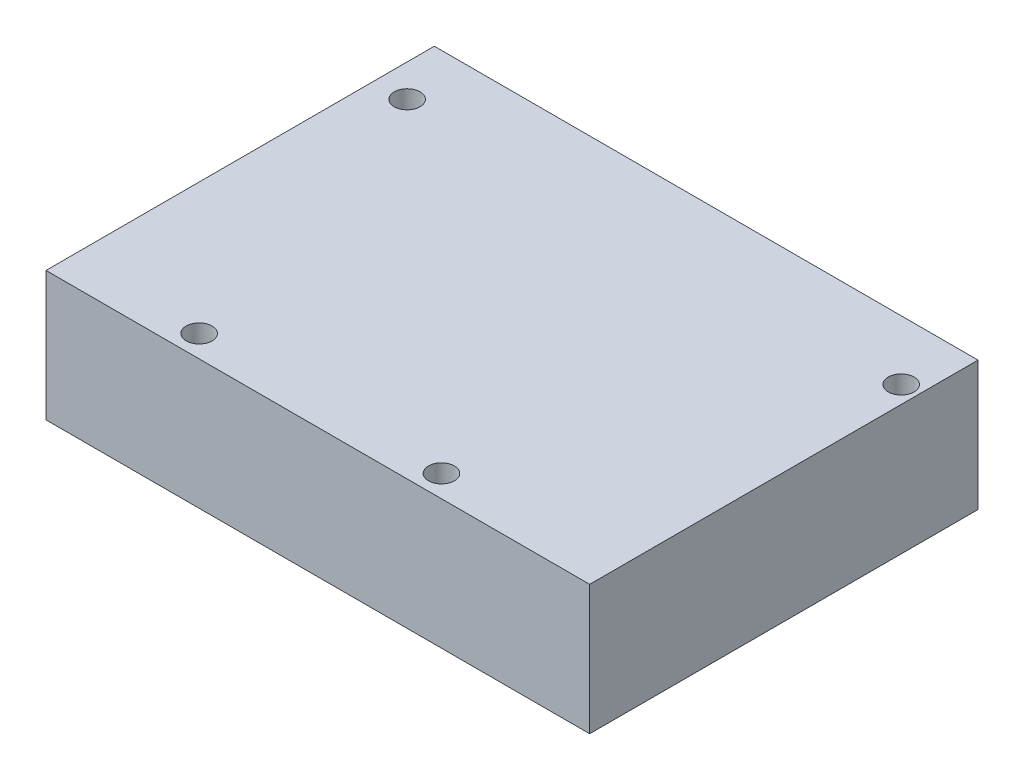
ISO-10303-21;
HEADER;
FILE_DESCRIPTION(('STEP AP214'),'2;1');
FILE_NAME('part.step','',(''),(''),'','','');
FILE_SCHEMA(('AUTOMOTIVE_DESIGN { 1 0 10303 214 1 1 1 1 }'));
ENDSEC;
DATA;
#1=APPLICATION_CONTEXT('core data for automotive mechanical design processes');
#2=APPLICATION_PROTOCOL_DEFINITION('international standard','automotive_design',2000,#1);
#3=PRODUCT_CONTEXT('',#1,'mechanical');
#4=PRODUCT('Part','Part','',(#3));
#5=PRODUCT_RELATED_PRODUCT_CATEGORY('part','',(#4));
#6=PRODUCT_DEFINITION_FORMATION('','',#4);
#7=PRODUCT_DEFINITION_CONTEXT('part definition',#1,'design');
#8=PRODUCT_DEFINITION('design','',#6,#7);
#9=PRODUCT_DEFINITION_SHAPE('','',#8);
#10=(LENGTH_UNIT() NAMED_UNIT(*) SI_UNIT(.MILLI.,.METRE.));
#11=(NAMED_UNIT(*) PLANE_ANGLE_UNIT() SI_UNIT($,.RADIAN.));
#12=(NAMED_UNIT(*) SI_UNIT($,.STERADIAN.) SOLID_ANGLE_UNIT());
#13=UNCERTAINTY_MEASURE_WITH_UNIT(LENGTH_MEASURE(1.E-05),#10,'distance_accuracy_value','');
#14=(GEOMETRIC_REPRESENTATION_CONTEXT(3) GLOBAL_UNCERTAINTY_ASSIGNED_CONTEXT((#13)) GLOBAL_UNIT_ASSIGNED_CONTEXT((#10,
#11,#12)) REPRESENTATION_CONTEXT('',''));
#15=CARTESIAN_POINT('',(0.,0.,0.));
#16=DIRECTION('',(0.,0.,1.));
#17=DIRECTION('',(1.,0.,0.));
#18=AXIS2_PLACEMENT_3D('',#15,#16,#17);
#19=CARTESIAN_POINT('',(-8.5,-5.,-7.5));
#20=DIRECTION('',(-1.,0.,0.));
#21=DIRECTION('',(0.,0.,1.));
#22=AXIS2_PLACEMENT_3D('',#19,#20,#21);
#23=PLANE('',#22);
#24=DIRECTION('',(0.,0.,1.));
#25=VECTOR('',#24,1.);
#26=CARTESIAN_POINT('',(-8.5,0.,-7.5));
#27=LINE('',#26,#25);
#28=CARTESIAN_POINT('',(-8.5,0.,-7.5));
#29=VERTEX_POINT('',#28);
#30=CARTESIAN_POINT('',(-8.5,0.,7.5));
#31=VERTEX_POINT('',#30);
#32=EDGE_CURVE('E116',#29,#31,#27,.T.);
#33=ORIENTED_EDGE('',*,*,#32,.F.);
#34=DIRECTION('',(0.,1.,0.));
#35=VECTOR('',#34,1.);
#36=CARTESIAN_POINT('',(-8.5,-5.,-7.5));
#37=LINE('',#36,#35);
#38=CARTESIAN_POINT('',(-8.5,-5.,-7.5));
#39=VERTEX_POINT('',#38);
#40=EDGE_CURVE('E11',#39,#29,#37,.T.);
#41=ORIENTED_EDGE('',*,*,#40,.F.);
#42=DIRECTION('',(0.,0.,1.));
#43=VECTOR('',#42,1.);
#44=CARTESIAN_POINT('',(-8.5,-5.,-7.5));
#45=LINE('',#44,#43);
#46=CARTESIAN_POINT('',(-8.5,-5.,7.5));
#47=VERTEX_POINT('',#46);
#48=EDGE_CURVE('E107',#39,#47,#45,.T.);
#49=ORIENTED_EDGE('',*,*,#48,.T.);
#50=DIRECTION('',(0.,1.,0.));
#51=VECTOR('',#50,1.);
#52=CARTESIAN_POINT('',(-8.5,-5.,7.5));
#53=LINE('',#52,#51);
#54=EDGE_CURVE('E48',#47,#31,#53,.T.);
#55=ORIENTED_EDGE('',*,*,#54,.T.);
#56=EDGE_LOOP('',(#33,#41,#49,#55));
#57=FACE_BOUND('',#56,.T.);
#58=ADVANCED_FACE('F45',(#57),#23,.T.);
#59=CARTESIAN_POINT('',(-8.5,-5.,-7.5));
#60=DIRECTION('',(0.,0.,-1.));
#61=DIRECTION('',(-1.,0.,0.));
#62=AXIS2_PLACEMENT_3D('',#59,#60,#61);
#63=PLANE('',#62);
#64=DIRECTION('',(-1.,0.,0.));
#65=VECTOR('',#64,1.);
#66=CARTESIAN_POINT('',(-8.5,0.,-7.5));
#67=LINE('',#66,#65);
#68=CARTESIAN_POINT('',(12.5,0.,-7.5));
#69=VERTEX_POINT('',#68);
#70=EDGE_CURVE('E110',#69,#29,#67,.T.);
#71=ORIENTED_EDGE('',*,*,#70,.F.);
#72=DIRECTION('',(0.,1.,0.));
#73=VECTOR('',#72,1.);
#74=CARTESIAN_POINT('',(12.5,-5.,-7.5));
#75=LINE('',#74,#73);
#76=CARTESIAN_POINT('',(12.5,-5.,-7.5));
#77=VERTEX_POINT('',#76);
#78=EDGE_CURVE('E55',#77,#69,#75,.T.);
#79=ORIENTED_EDGE('',*,*,#78,.F.);
#80=DIRECTION('',(-1.,0.,0.));
#81=VECTOR('',#80,1.);
#82=CARTESIAN_POINT('',(-8.5,-5.,-7.5));
#83=LINE('',#82,#81);
#84=EDGE_CURVE('E102',#77,#39,#83,.T.);
#85=ORIENTED_EDGE('',*,*,#84,.T.);
#86=ORIENTED_EDGE('',*,*,#40,.T.);
#87=EDGE_LOOP('',(#71,#79,#85,#86));
#88=FACE_BOUND('',#87,.T.);
#89=ADVANCED_FACE('F133',(#88),#63,.T.);
#90=CARTESIAN_POINT('',(12.5,-5.,-7.5));
#91=DIRECTION('',(1.,0.,0.));
#92=DIRECTION('',(0.,0.,-1.));
#93=AXIS2_PLACEMENT_3D('',#90,#91,#92);
#94=PLANE('',#93);
#95=DIRECTION('',(0.,0.,-1.));
#96=VECTOR('',#95,1.);
#97=CARTESIAN_POINT('',(12.5,0.,-7.5));
#98=LINE('',#97,#96);
#99=CARTESIAN_POINT('',(12.5,0.,7.5));
#100=VERTEX_POINT('',#99);
#101=EDGE_CURVE('E96',#100,#69,#98,.T.);
#102=ORIENTED_EDGE('',*,*,#101,.F.);
#103=DIRECTION('',(0.,1.,0.));
#104=VECTOR('',#103,1.);
#105=CARTESIAN_POINT('',(12.5,-5.,7.5));
#106=LINE('',#105,#104);
#107=CARTESIAN_POINT('',(12.5,-5.,7.5));
#108=VERTEX_POINT('',#107);
#109=EDGE_CURVE('E91',#108,#100,#106,.T.);
#110=ORIENTED_EDGE('',*,*,#109,.F.);
#111=DIRECTION('',(0.,0.,-1.));
#112=VECTOR('',#111,1.);
#113=CARTESIAN_POINT('',(12.5,-5.,-7.5));
#114=LINE('',#113,#112);
#115=EDGE_CURVE('E94',#108,#77,#114,.T.);
#116=ORIENTED_EDGE('',*,*,#115,.T.);
#117=ORIENTED_EDGE('',*,*,#78,.T.);
#118=EDGE_LOOP('',(#102,#110,#116,#117));
#119=FACE_BOUND('',#118,.T.);
#120=ADVANCED_FACE('F93',(#119),#94,.T.);
#121=CARTESIAN_POINT('',(-8.5,-5.,7.5));
#122=DIRECTION('',(0.,0.,1.));
#123=DIRECTION('',(1.,0.,0.));
#124=AXIS2_PLACEMENT_3D('',#121,#122,#123);
#125=PLANE('',#124);
#126=DIRECTION('',(1.,0.,0.));
#127=VECTOR('',#126,1.);
#128=CARTESIAN_POINT('',(-8.5,0.,7.5));
#129=LINE('',#128,#127);
#130=EDGE_CURVE('E120',#31,#100,#129,.T.);
#131=ORIENTED_EDGE('',*,*,#130,.F.);
#132=ORIENTED_EDGE('',*,*,#54,.F.);
#133=DIRECTION('',(1.,0.,0.));
#134=VECTOR('',#133,1.);
#135=CARTESIAN_POINT('',(-8.5,-5.,7.5));
#136=LINE('',#135,#134);
#137=EDGE_CURVE('E101',#47,#108,#136,.T.);
#138=ORIENTED_EDGE('',*,*,#137,.T.);
#139=ORIENTED_EDGE('',*,*,#109,.T.);
#140=EDGE_LOOP('',(#131,#132,#138,#139));
#141=FACE_BOUND('',#140,.T.);
#142=ADVANCED_FACE('F105',(#141),#125,.T.);
#143=CARTESIAN_POINT('',(0.,-5.,0.));
#144=DIRECTION('',(0.,1.,0.));
#145=DIRECTION('',(0.,0.,1.));
#146=AXIS2_PLACEMENT_3D('',#143,#144,#145);
#147=PLANE('',#146);
#148=CARTESIAN_POINT('',(-7.25,-5.,-5.2));
#149=DIRECTION('',(0.,1.,0.));
#150=DIRECTION('',(0.,0.,1.));
#151=AXIS2_PLACEMENT_3D('',#148,#149,#150);
#152=CIRCLE('',#151,0.5);
#153=CARTESIAN_POINT('',(-7.25,-5.,-4.7));
#154=VERTEX_POINT('',#153);
#155=EDGE_CURVE('E121',#154,#154,#152,.T.);
#156=ORIENTED_EDGE('',*,*,#155,.T.);
#157=EDGE_LOOP('',(#156));
#158=FACE_BOUND('',#157,.T.);
#159=CARTESIAN_POINT('',(11.8313056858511,-5.,-5.2));
#160=DIRECTION('',(0.,1.,0.));
#161=DIRECTION('',(0.,0.,1.));
#162=AXIS2_PLACEMENT_3D('',#159,#160,#161);
#163=CIRCLE('',#162,0.500000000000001);
#164=CARTESIAN_POINT('',(11.8313056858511,-5.,-4.7));
#165=VERTEX_POINT('',#164);
#166=EDGE_CURVE('E184',#165,#165,#163,.T.);
#167=ORIENTED_EDGE('',*,*,#166,.T.);
#168=EDGE_LOOP('',(#167));
#169=FACE_BOUND('',#168,.T.);
#170=CARTESIAN_POINT('',(5.92624028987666,-5.,6.65105105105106));
#171=DIRECTION('',(0.,1.,0.));
#172=DIRECTION('',(0.,0.,1.));
#173=AXIS2_PLACEMENT_3D('',#170,#171,#172);
#174=CIRCLE('',#173,0.500000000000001);
#175=CARTESIAN_POINT('',(5.92624028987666,-5.,7.15105105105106));
#176=VERTEX_POINT('',#175);
#177=EDGE_CURVE('E194',#176,#176,#174,.T.);
#178=ORIENTED_EDGE('',*,*,#177,.T.);
#179=EDGE_LOOP('',(#178));
#180=FACE_BOUND('',#179,.T.);
#181=CARTESIAN_POINT('',(-3.43391656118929,-5.,6.65105105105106));
#182=DIRECTION('',(0.,1.,0.));
#183=DIRECTION('',(0.,0.,1.));
#184=AXIS2_PLACEMENT_3D('',#181,#182,#183);
#185=CIRCLE('',#184,0.5);
#186=CARTESIAN_POINT('',(-3.43391656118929,-5.,7.15105105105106));
#187=VERTEX_POINT('',#186);
#188=EDGE_CURVE('E201',#187,#187,#185,.T.);
#189=ORIENTED_EDGE('',*,*,#188,.T.);
#190=EDGE_LOOP('',(#189));
#191=FACE_BOUND('',#190,.T.);
#192=ORIENTED_EDGE('',*,*,#48,.F.);
#193=ORIENTED_EDGE('',*,*,#84,.F.);
#194=ORIENTED_EDGE('',*,*,#115,.F.);
#195=ORIENTED_EDGE('',*,*,#137,.F.);
#196=EDGE_LOOP('',(#192,#193,#194,#195));
#197=FACE_BOUND('',#196,.T.);
#198=ADVANCED_FACE('F100',(#158,#169,#180,#191,#197),#147,.F.);
#199=CARTESIAN_POINT('',(0.,0.,0.));
#200=DIRECTION('',(0.,1.,0.));
#201=DIRECTION('',(0.,0.,1.));
#202=AXIS2_PLACEMENT_3D('',#199,#200,#201);
#203=PLANE('',#202);
#204=CARTESIAN_POINT('',(-7.25,0.,-5.2));
#205=DIRECTION('',(0.,1.,0.));
#206=DIRECTION('',(0.,0.,1.));
#207=AXIS2_PLACEMENT_3D('',#204,#205,#206);
#208=CIRCLE('',#207,0.5);
#209=CARTESIAN_POINT('',(-7.25,0.,-4.7));
#210=VERTEX_POINT('',#209);
#211=EDGE_CURVE('E176',#210,#210,#208,.T.);
#212=ORIENTED_EDGE('',*,*,#211,.F.);
#213=EDGE_LOOP('',(#212));
#214=FACE_BOUND('',#213,.T.);
#215=CARTESIAN_POINT('',(11.8313056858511,0.,-5.2));
#216=DIRECTION('',(0.,1.,0.));
#217=DIRECTION('',(0.,0.,1.));
#218=AXIS2_PLACEMENT_3D('',#215,#216,#217);
#219=CIRCLE('',#218,0.500000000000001);
#220=CARTESIAN_POINT('',(11.8313056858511,0.,-4.7));
#221=VERTEX_POINT('',#220);
#222=EDGE_CURVE('E178',#221,#221,#219,.T.);
#223=ORIENTED_EDGE('',*,*,#222,.F.);
#224=EDGE_LOOP('',(#223));
#225=FACE_BOUND('',#224,.T.);
#226=CARTESIAN_POINT('',(5.92624028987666,0.,6.65105105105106));
#227=DIRECTION('',(0.,1.,0.));
#228=DIRECTION('',(0.,0.,1.));
#229=AXIS2_PLACEMENT_3D('',#226,#227,#228);
#230=CIRCLE('',#229,0.500000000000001);
#231=CARTESIAN_POINT('',(5.92624028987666,0.,7.15105105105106));
#232=VERTEX_POINT('',#231);
#233=EDGE_CURVE('E190',#232,#232,#230,.T.);
#234=ORIENTED_EDGE('',*,*,#233,.F.);
#235=EDGE_LOOP('',(#234));
#236=FACE_BOUND('',#235,.T.);
#237=CARTESIAN_POINT('',(-3.43391656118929,0.,6.65105105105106));
#238=DIRECTION('',(0.,1.,0.));
#239=DIRECTION('',(0.,0.,1.));
#240=AXIS2_PLACEMENT_3D('',#237,#238,#239);
#241=CIRCLE('',#240,0.5);
#242=CARTESIAN_POINT('',(-3.43391656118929,0.,7.15105105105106));
#243=VERTEX_POINT('',#242);
#244=EDGE_CURVE('E198',#243,#243,#241,.T.);
#245=ORIENTED_EDGE('',*,*,#244,.F.);
#246=EDGE_LOOP('',(#245));
#247=FACE_BOUND('',#246,.T.);
#248=ORIENTED_EDGE('',*,*,#32,.T.);
#249=ORIENTED_EDGE('',*,*,#130,.T.);
#250=ORIENTED_EDGE('',*,*,#101,.T.);
#251=ORIENTED_EDGE('',*,*,#70,.T.);
#252=EDGE_LOOP('',(#248,#249,#250,#251));
#253=FACE_BOUND('',#252,.T.);
#254=ADVANCED_FACE('F132',(#214,#225,#236,#247,#253),#203,.T.);
#255=CARTESIAN_POINT('',(-3.43391656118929,-5.,6.65105105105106));
#256=DIRECTION('',(0.,1.,0.));
#257=DIRECTION('',(0.,0.,1.));
#258=AXIS2_PLACEMENT_3D('',#255,#256,#257);
#259=CYLINDRICAL_SURFACE('',#258,0.5);
#260=ORIENTED_EDGE('',*,*,#188,.F.);
#261=EDGE_LOOP('',(#260));
#262=FACE_BOUND('',#261,.T.);
#263=ORIENTED_EDGE('',*,*,#244,.T.);
#264=EDGE_LOOP('',(#263));
#265=FACE_BOUND('',#264,.T.);
#266=ADVANCED_FACE('F151',(#262,#265),#259,.F.);
#267=CARTESIAN_POINT('',(5.92624028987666,-5.,6.65105105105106));
#268=DIRECTION('',(0.,1.,0.));
#269=DIRECTION('',(0.,0.,1.));
#270=AXIS2_PLACEMENT_3D('',#267,#268,#269);
#271=CYLINDRICAL_SURFACE('',#270,0.500000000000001);
#272=ORIENTED_EDGE('',*,*,#177,.F.);
#273=EDGE_LOOP('',(#272));
#274=FACE_BOUND('',#273,.T.);
#275=ORIENTED_EDGE('',*,*,#233,.T.);
#276=EDGE_LOOP('',(#275));
#277=FACE_BOUND('',#276,.T.);
#278=ADVANCED_FACE('F158',(#274,#277),#271,.F.);
#279=CARTESIAN_POINT('',(11.8313056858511,-5.,-5.2));
#280=DIRECTION('',(0.,1.,0.));
#281=DIRECTION('',(0.,0.,1.));
#282=AXIS2_PLACEMENT_3D('',#279,#280,#281);
#283=CYLINDRICAL_SURFACE('',#282,0.500000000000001);
#284=ORIENTED_EDGE('',*,*,#166,.F.);
#285=EDGE_LOOP('',(#284));
#286=FACE_BOUND('',#285,.T.);
#287=ORIENTED_EDGE('',*,*,#222,.T.);
#288=EDGE_LOOP('',(#287));
#289=FACE_BOUND('',#288,.T.);
#290=ADVANCED_FACE('F162',(#286,#289),#283,.F.);
#291=CARTESIAN_POINT('',(-7.25,-5.,-5.2));
#292=DIRECTION('',(0.,1.,0.));
#293=DIRECTION('',(0.,0.,1.));
#294=AXIS2_PLACEMENT_3D('',#291,#292,#293);
#295=CYLINDRICAL_SURFACE('',#294,0.5);
#296=ORIENTED_EDGE('',*,*,#155,.F.);
#297=EDGE_LOOP('',(#296));
#298=FACE_BOUND('',#297,.T.);
#299=ORIENTED_EDGE('',*,*,#211,.T.);
#300=EDGE_LOOP('',(#299));
#301=FACE_BOUND('',#300,.T.);
#302=ADVANCED_FACE('F166',(#298,#301),#295,.F.);
#303=CLOSED_SHELL('',(#58,#89,#120,#142,#198,#254,#266,#278,#290,#302));
#304=MANIFOLD_SOLID_BREP('B2',#303);
#305=ADVANCED_BREP_SHAPE_REPRESENTATION('',(#18,#304),#14);
#306=SHAPE_DEFINITION_REPRESENTATION(#9,#305);
ENDSEC;
END-ISO-10303-21;
